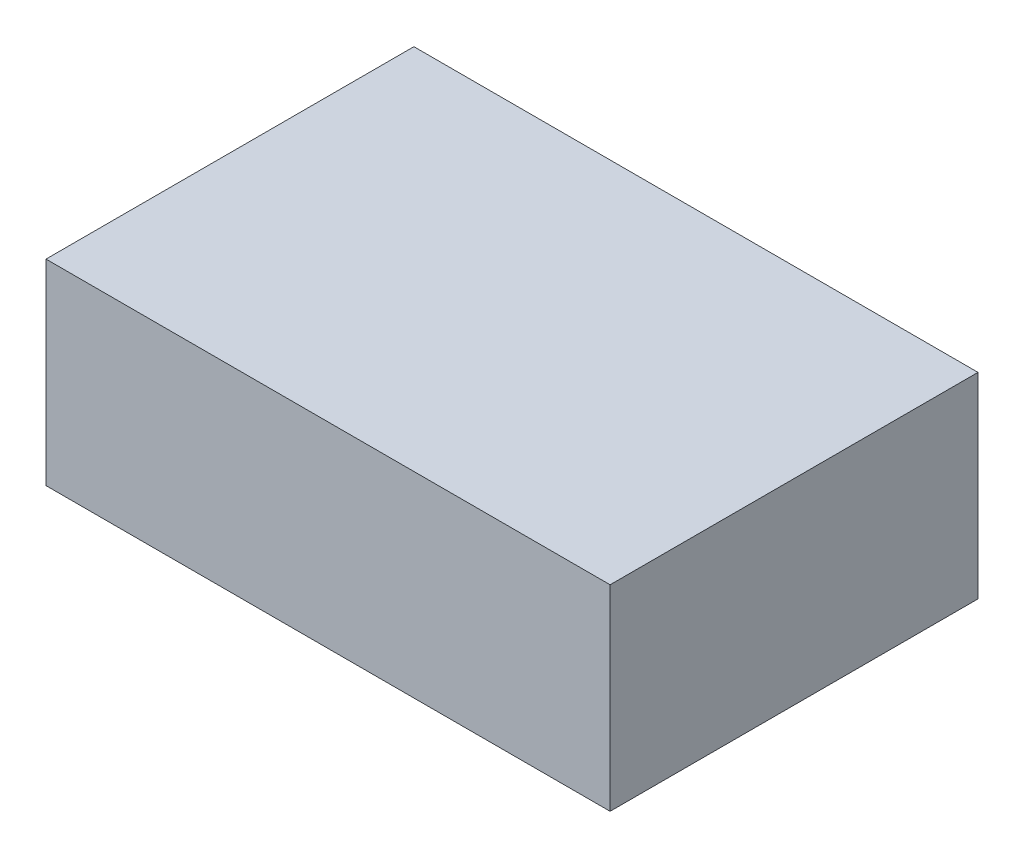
ISO-10303-21;
HEADER;
FILE_DESCRIPTION(('STEP AP214'),'2;1');
FILE_NAME('part.step','',(''),(''),'','','');
FILE_SCHEMA(('AUTOMOTIVE_DESIGN { 1 0 10303 214 1 1 1 1 }'));
ENDSEC;
DATA;
#1=APPLICATION_CONTEXT('core data for automotive mechanical design processes');
#2=APPLICATION_PROTOCOL_DEFINITION('international standard','automotive_design',2000,#1);
#3=PRODUCT_CONTEXT('',#1,'mechanical');
#4=PRODUCT('Part','Part','',(#3));
#5=PRODUCT_RELATED_PRODUCT_CATEGORY('part','',(#4));
#6=PRODUCT_DEFINITION_FORMATION('','',#4);
#7=PRODUCT_DEFINITION_CONTEXT('part definition',#1,'design');
#8=PRODUCT_DEFINITION('design','',#6,#7);
#9=PRODUCT_DEFINITION_SHAPE('','',#8);
#10=(LENGTH_UNIT() NAMED_UNIT(*) SI_UNIT(.MILLI.,.METRE.));
#11=(NAMED_UNIT(*) PLANE_ANGLE_UNIT() SI_UNIT($,.RADIAN.));
#12=(NAMED_UNIT(*) SI_UNIT($,.STERADIAN.) SOLID_ANGLE_UNIT());
#13=UNCERTAINTY_MEASURE_WITH_UNIT(LENGTH_MEASURE(1.E-05),#10,'distance_accuracy_value','');
#14=(GEOMETRIC_REPRESENTATION_CONTEXT(3) GLOBAL_UNCERTAINTY_ASSIGNED_CONTEXT((#13)) GLOBAL_UNIT_ASSIGNED_CONTEXT((#10,
#11,#12)) REPRESENTATION_CONTEXT('',''));
#15=CARTESIAN_POINT('',(0.,0.,0.));
#16=DIRECTION('',(0.,0.,1.));
#17=DIRECTION('',(1.,0.,0.));
#18=AXIS2_PLACEMENT_3D('',#15,#16,#17);
#19=CARTESIAN_POINT('',(48.,18.,30.));
#20=DIRECTION('',(0.,-1.,0.));
#21=DIRECTION('',(0.,0.,-1.));
#22=AXIS2_PLACEMENT_3D('',#19,#20,#21);
#23=PLANE('',#22);
#24=DIRECTION('',(-1.,0.,0.));
#25=VECTOR('',#24,1.);
#26=CARTESIAN_POINT('',(48.,18.,0.));
#27=LINE('',#26,#25);
#28=CARTESIAN_POINT('',(48.,18.,0.));
#29=VERTEX_POINT('',#28);
#30=CARTESIAN_POINT('',(2.,18.,0.));
#31=VERTEX_POINT('',#30);
#32=EDGE_CURVE('E94',#29,#31,#27,.T.);
#33=ORIENTED_EDGE('',*,*,#32,.T.);
#34=DIRECTION('',(0.,0.,-1.));
#35=VECTOR('',#34,1.);
#36=CARTESIAN_POINT('',(2.,18.,30.));
#37=LINE('',#36,#35);
#38=CARTESIAN_POINT('',(2.,18.,30.));
#39=VERTEX_POINT('',#38);
#40=EDGE_CURVE('E11',#39,#31,#37,.T.);
#41=ORIENTED_EDGE('',*,*,#40,.F.);
#42=DIRECTION('',(-1.,0.,0.));
#43=VECTOR('',#42,1.);
#44=CARTESIAN_POINT('',(48.,18.,30.));
#45=LINE('',#44,#43);
#46=CARTESIAN_POINT('',(48.,18.,30.));
#47=VERTEX_POINT('',#46);
#48=EDGE_CURVE('E82',#47,#39,#45,.T.);
#49=ORIENTED_EDGE('',*,*,#48,.F.);
#50=DIRECTION('',(0.,0.,-1.));
#51=VECTOR('',#50,1.);
#52=CARTESIAN_POINT('',(48.,18.,30.));
#53=LINE('',#52,#51);
#54=EDGE_CURVE('E90',#47,#29,#53,.T.);
#55=ORIENTED_EDGE('',*,*,#54,.T.);
#56=EDGE_LOOP('',(#33,#41,#49,#55));
#57=FACE_BOUND('',#56,.T.);
#58=ADVANCED_FACE('F31',(#57),#23,.F.);
#59=CARTESIAN_POINT('',(2.,18.,30.));
#60=DIRECTION('',(1.,0.,0.));
#61=DIRECTION('',(0.,0.,-1.));
#62=AXIS2_PLACEMENT_3D('',#59,#60,#61);
#63=PLANE('',#62);
#64=DIRECTION('',(0.,-1.,0.));
#65=VECTOR('',#64,1.);
#66=CARTESIAN_POINT('',(2.,18.,0.));
#67=LINE('',#66,#65);
#68=CARTESIAN_POINT('',(2.,2.,0.));
#69=VERTEX_POINT('',#68);
#70=EDGE_CURVE('E86',#31,#69,#67,.T.);
#71=ORIENTED_EDGE('',*,*,#70,.T.);
#72=DIRECTION('',(0.,0.,-1.));
#73=VECTOR('',#72,1.);
#74=CARTESIAN_POINT('',(2.,2.,30.));
#75=LINE('',#74,#73);
#76=CARTESIAN_POINT('',(2.,2.,30.));
#77=VERTEX_POINT('',#76);
#78=EDGE_CURVE('E39',#77,#69,#75,.T.);
#79=ORIENTED_EDGE('',*,*,#78,.F.);
#80=DIRECTION('',(0.,-1.,0.));
#81=VECTOR('',#80,1.);
#82=CARTESIAN_POINT('',(2.,18.,30.));
#83=LINE('',#82,#81);
#84=EDGE_CURVE('E77',#39,#77,#83,.T.);
#85=ORIENTED_EDGE('',*,*,#84,.F.);
#86=ORIENTED_EDGE('',*,*,#40,.T.);
#87=EDGE_LOOP('',(#71,#79,#85,#86));
#88=FACE_BOUND('',#87,.T.);
#89=ADVANCED_FACE('F85',(#88),#63,.F.);
#90=CARTESIAN_POINT('',(2.,2.,30.));
#91=DIRECTION('',(0.,1.,0.));
#92=DIRECTION('',(0.,0.,1.));
#93=AXIS2_PLACEMENT_3D('',#90,#91,#92);
#94=PLANE('',#93);
#95=DIRECTION('',(1.,0.,0.));
#96=VECTOR('',#95,1.);
#97=CARTESIAN_POINT('',(2.,2.,0.));
#98=LINE('',#97,#96);
#99=CARTESIAN_POINT('',(48.,2.,0.));
#100=VERTEX_POINT('',#99);
#101=EDGE_CURVE('E64',#69,#100,#98,.T.);
#102=ORIENTED_EDGE('',*,*,#101,.T.);
#103=DIRECTION('',(0.,0.,-1.));
#104=VECTOR('',#103,1.);
#105=CARTESIAN_POINT('',(48.,2.,30.));
#106=LINE('',#105,#104);
#107=CARTESIAN_POINT('',(48.,2.,30.));
#108=VERTEX_POINT('',#107);
#109=EDGE_CURVE('E87',#108,#100,#106,.T.);
#110=ORIENTED_EDGE('',*,*,#109,.F.);
#111=DIRECTION('',(1.,0.,0.));
#112=VECTOR('',#111,1.);
#113=CARTESIAN_POINT('',(2.,2.,30.));
#114=LINE('',#113,#112);
#115=EDGE_CURVE('E80',#77,#108,#114,.T.);
#116=ORIENTED_EDGE('',*,*,#115,.F.);
#117=ORIENTED_EDGE('',*,*,#78,.T.);
#118=EDGE_LOOP('',(#102,#110,#116,#117));
#119=FACE_BOUND('',#118,.T.);
#120=ADVANCED_FACE('F88',(#119),#94,.F.);
#121=CARTESIAN_POINT('',(48.,2.,30.));
#122=DIRECTION('',(-1.,0.,0.));
#123=DIRECTION('',(0.,0.,1.));
#124=AXIS2_PLACEMENT_3D('',#121,#122,#123);
#125=PLANE('',#124);
#126=DIRECTION('',(0.,1.,0.));
#127=VECTOR('',#126,1.);
#128=CARTESIAN_POINT('',(48.,2.,0.));
#129=LINE('',#128,#127);
#130=EDGE_CURVE('E70',#100,#29,#129,.T.);
#131=ORIENTED_EDGE('',*,*,#130,.T.);
#132=ORIENTED_EDGE('',*,*,#54,.F.);
#133=DIRECTION('',(0.,1.,0.));
#134=VECTOR('',#133,1.);
#135=CARTESIAN_POINT('',(48.,2.,30.));
#136=LINE('',#135,#134);
#137=EDGE_CURVE('E47',#108,#47,#136,.T.);
#138=ORIENTED_EDGE('',*,*,#137,.F.);
#139=ORIENTED_EDGE('',*,*,#109,.T.);
#140=EDGE_LOOP('',(#131,#132,#138,#139));
#141=FACE_BOUND('',#140,.T.);
#142=ADVANCED_FACE('F101',(#141),#125,.F.);
#143=CARTESIAN_POINT('',(2.,18.,30.));
#144=DIRECTION('',(0.,0.,1.));
#145=DIRECTION('',(1.,0.,0.));
#146=AXIS2_PLACEMENT_3D('',#143,#144,#145);
#147=PLANE('',#146);
#148=ORIENTED_EDGE('',*,*,#48,.T.);
#149=ORIENTED_EDGE('',*,*,#84,.T.);
#150=ORIENTED_EDGE('',*,*,#115,.T.);
#151=ORIENTED_EDGE('',*,*,#137,.T.);
#152=EDGE_LOOP('',(#148,#149,#150,#151));
#153=FACE_BOUND('',#152,.T.);
#154=ADVANCED_FACE('F78',(#153),#147,.T.);
#155=CARTESIAN_POINT('',(2.,18.,0.));
#156=DIRECTION('',(0.,0.,1.));
#157=DIRECTION('',(1.,0.,0.));
#158=AXIS2_PLACEMENT_3D('',#155,#156,#157);
#159=PLANE('',#158);
#160=ORIENTED_EDGE('',*,*,#32,.F.);
#161=ORIENTED_EDGE('',*,*,#130,.F.);
#162=ORIENTED_EDGE('',*,*,#101,.F.);
#163=ORIENTED_EDGE('',*,*,#70,.F.);
#164=EDGE_LOOP('',(#160,#161,#162,#163));
#165=FACE_BOUND('',#164,.T.);
#166=ADVANCED_FACE('F104',(#165),#159,.F.);
#167=CLOSED_SHELL('',(#58,#89,#120,#142,#154,#166));
#168=MANIFOLD_SOLID_BREP('B2',#167);
#169=ADVANCED_BREP_SHAPE_REPRESENTATION('',(#18,#168),#14);
#170=SHAPE_DEFINITION_REPRESENTATION(#9,#169);
ENDSEC;
END-ISO-10303-21;
